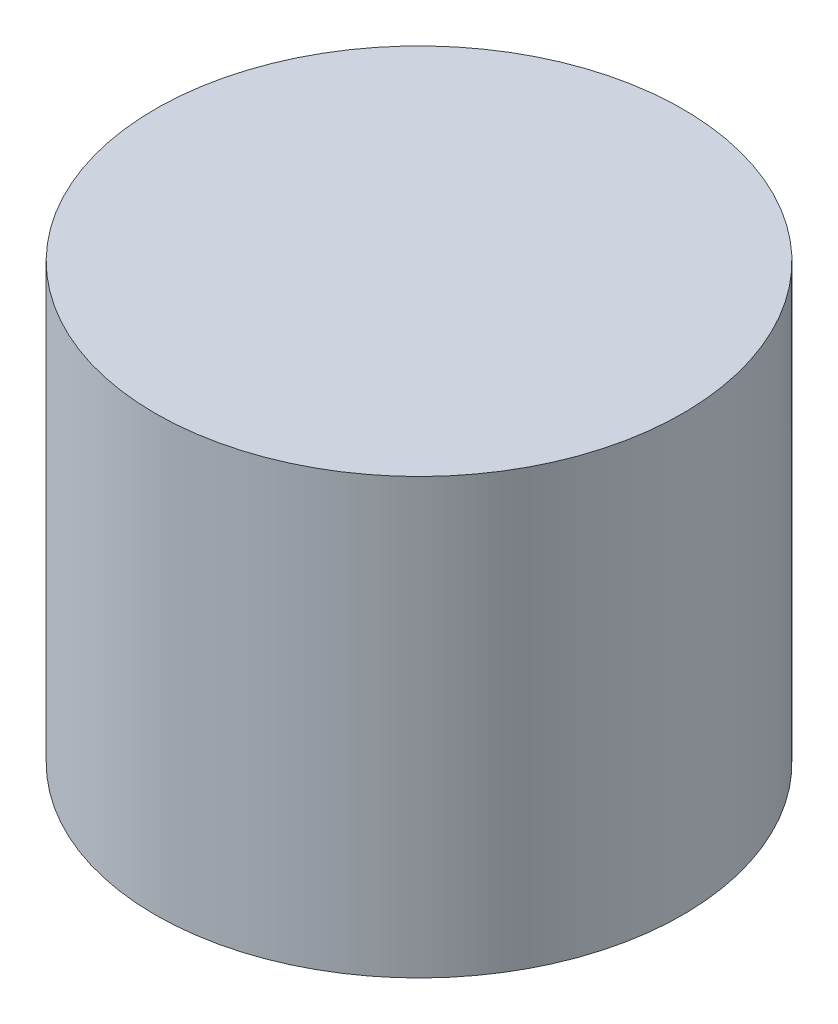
from build123d import *

# Parameters (mm, degrees)
SKETCH3_R           = 4.25
BOSS_EXTRUDE1_DEPTH = 7


with BuildPart() as part:
    # Sketch3 → Boss-Extrude1 (new body)
    with BuildSketch(Plane(origin=(0, 0, 0), x_dir=(-1, 0, 0), z_dir=(0, 1, 0))):
        with Locations(Location((54, 28, 0), (0, 0, 90))):
            Circle(SKETCH3_R)
    extrude(amount=BOSS_EXTRUDE1_DEPTH)


solid = part.part
